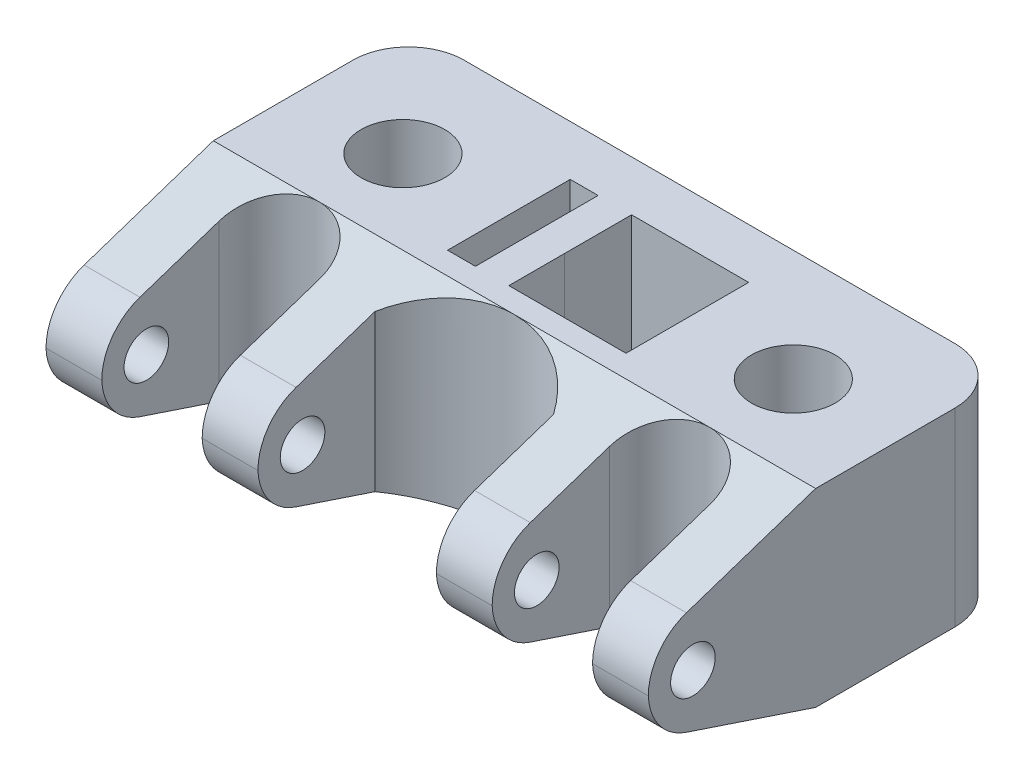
ISO-10303-21;
HEADER;
FILE_DESCRIPTION(('STEP AP214'),'2;1');
FILE_NAME('part.step','',(''),(''),'','','');
FILE_SCHEMA(('AUTOMOTIVE_DESIGN { 1 0 10303 214 1 1 1 1 }'));
ENDSEC;
DATA;
#1=APPLICATION_CONTEXT('core data for automotive mechanical design processes');
#2=APPLICATION_PROTOCOL_DEFINITION('international standard','automotive_design',2000,#1);
#3=PRODUCT_CONTEXT('',#1,'mechanical');
#4=PRODUCT('Part','Part','',(#3));
#5=PRODUCT_RELATED_PRODUCT_CATEGORY('part','',(#4));
#6=PRODUCT_DEFINITION_FORMATION('','',#4);
#7=PRODUCT_DEFINITION_CONTEXT('part definition',#1,'design');
#8=PRODUCT_DEFINITION('design','',#6,#7);
#9=PRODUCT_DEFINITION_SHAPE('','',#8);
#10=(LENGTH_UNIT() NAMED_UNIT(*) SI_UNIT(.MILLI.,.METRE.));
#11=(NAMED_UNIT(*) PLANE_ANGLE_UNIT() SI_UNIT($,.RADIAN.));
#12=(NAMED_UNIT(*) SI_UNIT($,.STERADIAN.) SOLID_ANGLE_UNIT());
#13=UNCERTAINTY_MEASURE_WITH_UNIT(LENGTH_MEASURE(1.E-05),#10,'distance_accuracy_value','');
#14=(GEOMETRIC_REPRESENTATION_CONTEXT(3) GLOBAL_UNCERTAINTY_ASSIGNED_CONTEXT((#13)) GLOBAL_UNIT_ASSIGNED_CONTEXT((#10,
#11,#12)) REPRESENTATION_CONTEXT('',''));
#15=CARTESIAN_POINT('',(0.,0.,0.));
#16=DIRECTION('',(0.,0.,1.));
#17=DIRECTION('',(1.,0.,0.));
#18=AXIS2_PLACEMENT_3D('',#15,#16,#17);
#19=CARTESIAN_POINT('',(-10.9955993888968,0.,11.));
#20=DIRECTION('',(0.,0.,1.));
#21=DIRECTION('',(1.,0.,0.));
#22=AXIS2_PLACEMENT_3D('',#19,#20,#21);
#23=PLANE('',#22);
#24=DIRECTION('',(1.,0.,0.));
#25=VECTOR('',#24,1.);
#26=CARTESIAN_POINT('',(-10.9955993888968,0.,11.));
#27=LINE('',#26,#25);
#28=CARTESIAN_POINT('',(0.,0.,11.));
#29=VERTEX_POINT('',#28);
#30=CARTESIAN_POINT('',(21.0044006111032,0.,11.));
#31=VERTEX_POINT('',#30);
#32=EDGE_CURVE('E85',#29,#31,#27,.T.);
#33=ORIENTED_EDGE('',*,*,#32,.F.);
#34=DIRECTION('',(0.,1.,0.));
#35=VECTOR('',#34,1.);
#36=CARTESIAN_POINT('',(0.,0.,11.));
#37=LINE('',#36,#35);
#38=CARTESIAN_POINT('',(0.,34.,11.));
#39=VERTEX_POINT('',#38);
#40=EDGE_CURVE('E316',#29,#39,#37,.T.);
#41=ORIENTED_EDGE('',*,*,#40,.T.);
#42=DIRECTION('',(1.,0.,0.));
#43=VECTOR('',#42,1.);
#44=CARTESIAN_POINT('',(-10.9955993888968,34.,11.));
#45=LINE('',#44,#43);
#46=CARTESIAN_POINT('',(21.0044006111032,34.,11.));
#47=VERTEX_POINT('',#46);
#48=EDGE_CURVE('E507',#39,#47,#45,.T.);
#49=ORIENTED_EDGE('',*,*,#48,.T.);
#50=DIRECTION('',(0.,1.,0.));
#51=VECTOR('',#50,1.);
#52=CARTESIAN_POINT('',(21.0044006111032,0.,11.));
#53=LINE('',#52,#51);
#54=EDGE_CURVE('E509',#31,#47,#53,.T.);
#55=ORIENTED_EDGE('',*,*,#54,.F.);
#56=EDGE_LOOP('',(#33,#41,#49,#55));
#57=FACE_BOUND('',#56,.T.);
#58=ADVANCED_FACE('F70',(#57),#23,.F.);
#59=CARTESIAN_POINT('',(21.0044006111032,0.,-11.));
#60=DIRECTION('',(0.,0.,-1.));
#61=DIRECTION('',(-1.,0.,0.));
#62=AXIS2_PLACEMENT_3D('',#59,#60,#61);
#63=PLANE('',#62);
#64=DIRECTION('',(-1.,0.,0.));
#65=VECTOR('',#64,1.);
#66=CARTESIAN_POINT('',(21.0044006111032,34.,-11.));
#67=LINE('',#66,#65);
#68=CARTESIAN_POINT('',(21.0044006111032,34.,-11.));
#69=VERTEX_POINT('',#68);
#70=CARTESIAN_POINT('',(0.0044006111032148,34.,-11.));
#71=VERTEX_POINT('',#70);
#72=EDGE_CURVE('E502',#69,#71,#67,.T.);
#73=ORIENTED_EDGE('',*,*,#72,.T.);
#74=DIRECTION('',(0.,1.,0.));
#75=VECTOR('',#74,1.);
#76=CARTESIAN_POINT('',(0.00440061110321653,0.,-11.));
#77=LINE('',#76,#75);
#78=CARTESIAN_POINT('',(0.0044006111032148,0.,-11.));
#79=VERTEX_POINT('',#78);
#80=EDGE_CURVE('E315',#79,#71,#77,.T.);
#81=ORIENTED_EDGE('',*,*,#80,.F.);
#82=DIRECTION('',(-1.,0.,0.));
#83=VECTOR('',#82,1.);
#84=CARTESIAN_POINT('',(21.0044006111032,0.,-11.));
#85=LINE('',#84,#83);
#86=CARTESIAN_POINT('',(21.0044006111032,0.,-11.));
#87=VERTEX_POINT('',#86);
#88=EDGE_CURVE('E325',#87,#79,#85,.T.);
#89=ORIENTED_EDGE('',*,*,#88,.F.);
#90=DIRECTION('',(0.,1.,0.));
#91=VECTOR('',#90,1.);
#92=CARTESIAN_POINT('',(21.0044006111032,0.,-11.));
#93=LINE('',#92,#91);
#94=EDGE_CURVE('E498',#87,#69,#93,.T.);
#95=ORIENTED_EDGE('',*,*,#94,.T.);
#96=EDGE_LOOP('',(#73,#81,#89,#95));
#97=FACE_BOUND('',#96,.T.);
#98=ADVANCED_FACE('F669',(#97),#63,.F.);
#99=CARTESIAN_POINT('',(49.0044006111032,34.,15.));
#100=DIRECTION('',(1.,0.,0.));
#101=DIRECTION('',(0.,1.,0.));
#102=AXIS2_PLACEMENT_3D('',#99,#100,#101);
#103=PLANE('',#102);
#104=CARTESIAN_POINT('',(49.0044006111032,16.7924077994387,37.));
#105=DIRECTION('',(1.,0.,0.));
#106=DIRECTION('',(0.,1.,0.));
#107=AXIS2_PLACEMENT_3D('',#104,#105,#106);
#108=CIRCLE('',#107,4.);
#109=CARTESIAN_POINT('',(49.0044006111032,20.7924077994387,37.));
#110=VERTEX_POINT('',#109);
#111=EDGE_CURVE('E378',#110,#110,#108,.T.);
#112=ORIENTED_EDGE('',*,*,#111,.T.);
#113=EDGE_LOOP('',(#112));
#114=FACE_BOUND('',#113,.T.);
#115=DIRECTION('',(0.,0.316227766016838,0.948683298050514));
#116=VECTOR('',#115,1.);
#117=CARTESIAN_POINT('',(49.0044006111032,3.39999999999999,25.2));
#118=LINE('',#117,#116);
#119=CARTESIAN_POINT('',(49.0044006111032,3.,24.));
#120=VERTEX_POINT('',#119);
#121=CARTESIAN_POINT('',(49.0044006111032,7.72367394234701,38.171021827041));
#122=VERTEX_POINT('',#121);
#123=EDGE_CURVE('E394',#120,#122,#118,.T.);
#124=ORIENTED_EDGE('',*,*,#123,.T.);
#125=CARTESIAN_POINT('',(49.0044006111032,17.2105069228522,35.0087441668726));
#126=DIRECTION('',(1.,0.,0.));
#127=DIRECTION('',(0.,1.,0.));
#128=AXIS2_PLACEMENT_3D('',#125,#126,#127);
#129=CIRCLE('',#128,10.);
#130=CARTESIAN_POINT('',(49.0044006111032,16.7924077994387,45.));
#131=VERTEX_POINT('',#130);
#132=EDGE_CURVE('E586',#122,#131,#129,.F.);
#133=ORIENTED_EDGE('',*,*,#132,.T.);
#134=CARTESIAN_POINT('',(49.0044006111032,16.7924077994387,35.));
#135=DIRECTION('',(1.,0.,0.));
#136=DIRECTION('',(0.,1.,0.));
#137=AXIS2_PLACEMENT_3D('',#134,#135,#136);
#138=CIRCLE('',#137,10.);
#139=CARTESIAN_POINT('',(49.0044006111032,26.2792407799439,38.1622776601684));
#140=VERTEX_POINT('',#139);
#141=EDGE_CURVE('E577',#131,#140,#138,.F.);
#142=ORIENTED_EDGE('',*,*,#141,.T.);
#143=DIRECTION('',(0.,0.316227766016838,-0.948683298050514));
#144=VECTOR('',#143,1.);
#145=CARTESIAN_POINT('',(49.0044006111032,34.,15.));
#146=LINE('',#145,#144);
#147=CARTESIAN_POINT('',(49.0044006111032,31.,24.));
#148=VERTEX_POINT('',#147);
#149=EDGE_CURVE('E428',#140,#148,#146,.T.);
#150=ORIENTED_EDGE('',*,*,#149,.T.);
#151=DIRECTION('',(0.,1.,0.));
#152=VECTOR('',#151,1.);
#153=CARTESIAN_POINT('',(49.0044006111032,0.,24.));
#154=LINE('',#153,#152);
#155=EDGE_CURVE('E449',#120,#148,#154,.T.);
#156=ORIENTED_EDGE('',*,*,#155,.F.);
#157=EDGE_LOOP('',(#124,#133,#142,#150,#156));
#158=FACE_BOUND('',#157,.T.);
#159=ADVANCED_FACE('F640',(#114,#158),#103,.F.);
#160=CARTESIAN_POINT('',(-20.9955993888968,34.,15.));
#161=DIRECTION('',(1.,0.,0.));
#162=DIRECTION('',(0.,1.,0.));
#163=AXIS2_PLACEMENT_3D('',#160,#161,#162);
#164=PLANE('',#163);
#165=CARTESIAN_POINT('',(-20.9955993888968,16.7924077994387,37.));
#166=DIRECTION('',(1.,0.,0.));
#167=DIRECTION('',(0.,1.,0.));
#168=AXIS2_PLACEMENT_3D('',#165,#166,#167);
#169=CIRCLE('',#168,4.);
#170=CARTESIAN_POINT('',(-20.9955993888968,20.7924077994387,37.));
#171=VERTEX_POINT('',#170);
#172=EDGE_CURVE('E375',#171,#171,#169,.T.);
#173=ORIENTED_EDGE('',*,*,#172,.T.);
#174=EDGE_LOOP('',(#173));
#175=FACE_BOUND('',#174,.T.);
#176=DIRECTION('',(0.,0.316227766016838,0.948683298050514));
#177=VECTOR('',#176,1.);
#178=CARTESIAN_POINT('',(-20.9955993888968,3.39999999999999,25.2));
#179=LINE('',#178,#177);
#180=CARTESIAN_POINT('',(-20.9955993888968,3.,24.));
#181=VERTEX_POINT('',#180);
#182=CARTESIAN_POINT('',(-20.9955993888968,7.72367394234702,38.1710218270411));
#183=VERTEX_POINT('',#182);
#184=EDGE_CURVE('E411',#181,#183,#179,.T.);
#185=ORIENTED_EDGE('',*,*,#184,.T.);
#186=CARTESIAN_POINT('',(-20.9955993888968,17.2105069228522,35.0087441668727));
#187=DIRECTION('',(1.,0.,0.));
#188=DIRECTION('',(0.,1.,0.));
#189=AXIS2_PLACEMENT_3D('',#186,#187,#188);
#190=CIRCLE('',#189,10.);
#191=CARTESIAN_POINT('',(-20.9955993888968,16.7924077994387,45.));
#192=VERTEX_POINT('',#191);
#193=EDGE_CURVE('E554',#183,#192,#190,.F.);
#194=ORIENTED_EDGE('',*,*,#193,.T.);
#195=CARTESIAN_POINT('',(-20.9955993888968,16.7924077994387,35.));
#196=DIRECTION('',(1.,0.,0.));
#197=DIRECTION('',(0.,1.,0.));
#198=AXIS2_PLACEMENT_3D('',#195,#196,#197);
#199=CIRCLE('',#198,10.);
#200=CARTESIAN_POINT('',(-20.9955993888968,26.2792407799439,38.1622776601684));
#201=VERTEX_POINT('',#200);
#202=EDGE_CURVE('E545',#192,#201,#199,.F.);
#203=ORIENTED_EDGE('',*,*,#202,.T.);
#204=DIRECTION('',(0.,0.316227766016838,-0.948683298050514));
#205=VECTOR('',#204,1.);
#206=CARTESIAN_POINT('',(-20.9955993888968,34.,15.));
#207=LINE('',#206,#205);
#208=CARTESIAN_POINT('',(-20.9955993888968,31.,24.));
#209=VERTEX_POINT('',#208);
#210=EDGE_CURVE('E445',#201,#209,#207,.T.);
#211=ORIENTED_EDGE('',*,*,#210,.T.);
#212=DIRECTION('',(0.,1.,0.));
#213=VECTOR('',#212,1.);
#214=CARTESIAN_POINT('',(-20.9955993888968,0.,24.));
#215=LINE('',#214,#213);
#216=EDGE_CURVE('E459',#181,#209,#215,.T.);
#217=ORIENTED_EDGE('',*,*,#216,.F.);
#218=EDGE_LOOP('',(#185,#194,#203,#211,#217));
#219=FACE_BOUND('',#218,.T.);
#220=ADVANCED_FACE('F709',(#175,#219),#164,.F.);
#221=CARTESIAN_POINT('',(0.,34.,0.));
#222=DIRECTION('',(0.,-1.,0.));
#223=DIRECTION('',(0.,0.,-1.));
#224=AXIS2_PLACEMENT_3D('',#221,#222,#223);
#225=PLANE('',#224);
#226=ORIENTED_EDGE('',*,*,#48,.F.);
#227=DIRECTION('',(0.,0.,-1.));
#228=VECTOR('',#227,1.);
#229=CARTESIAN_POINT('',(0.,34.,1.00000000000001));
#230=LINE('',#229,#228);
#231=CARTESIAN_POINT('',(0.,34.,1.00000000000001));
#232=VERTEX_POINT('',#231);
#233=EDGE_CURVE('E336',#39,#232,#230,.T.);
#234=ORIENTED_EDGE('',*,*,#233,.T.);
#235=DIRECTION('',(0.000366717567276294,0.,-0.999999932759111));
#236=VECTOR('',#235,1.);
#237=CARTESIAN_POINT('',(0.,34.,1.00000000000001));
#238=LINE('',#237,#236);
#239=EDGE_CURVE('E310',#232,#71,#238,.T.);
#240=ORIENTED_EDGE('',*,*,#239,.T.);
#241=ORIENTED_EDGE('',*,*,#72,.F.);
#242=DIRECTION('',(0.,0.,-1.));
#243=VECTOR('',#242,1.);
#244=CARTESIAN_POINT('',(21.0044006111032,34.,0.));
#245=LINE('',#244,#243);
#246=EDGE_CURVE('E485',#47,#69,#245,.T.);
#247=ORIENTED_EDGE('',*,*,#246,.F.);
#248=EDGE_LOOP('',(#226,#234,#240,#241,#247));
#249=FACE_BOUND('',#248,.T.);
#250=DIRECTION('',(0.,0.,1.));
#251=VECTOR('',#250,1.);
#252=CARTESIAN_POINT('',(59.0044006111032,34.,-20.));
#253=LINE('',#252,#251);
#254=CARTESIAN_POINT('',(59.0044006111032,34.,-10.));
#255=VERTEX_POINT('',#254);
#256=CARTESIAN_POINT('',(59.0044006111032,34.,15.));
#257=VERTEX_POINT('',#256);
#258=EDGE_CURVE('E463',#255,#257,#253,.T.);
#259=ORIENTED_EDGE('',*,*,#258,.F.);
#260=CARTESIAN_POINT('',(49.0044006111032,34.,-10.));
#261=DIRECTION('',(0.,-1.,0.));
#262=DIRECTION('',(0.,0.,-1.));
#263=AXIS2_PLACEMENT_3D('',#260,#261,#262);
#264=CIRCLE('',#263,10.);
#265=CARTESIAN_POINT('',(49.0044006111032,34.,-20.));
#266=VERTEX_POINT('',#265);
#267=EDGE_CURVE('E603',#255,#266,#264,.F.);
#268=ORIENTED_EDGE('',*,*,#267,.T.);
#269=DIRECTION('',(1.,0.,0.));
#270=VECTOR('',#269,1.);
#271=CARTESIAN_POINT('',(55.0044006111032,34.,-20.));
#272=LINE('',#271,#270);
#273=CARTESIAN_POINT('',(-38.9955993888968,34.,-20.));
#274=VERTEX_POINT('',#273);
#275=EDGE_CURVE('E472',#274,#266,#272,.T.);
#276=ORIENTED_EDGE('',*,*,#275,.F.);
#277=CARTESIAN_POINT('',(-38.9955993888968,34.,-10.));
#278=DIRECTION('',(0.,-1.,0.));
#279=DIRECTION('',(0.,0.,-1.));
#280=AXIS2_PLACEMENT_3D('',#277,#278,#279);
#281=CIRCLE('',#280,10.);
#282=CARTESIAN_POINT('',(-48.9955993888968,34.,-10.));
#283=VERTEX_POINT('',#282);
#284=EDGE_CURVE('E598',#274,#283,#281,.F.);
#285=ORIENTED_EDGE('',*,*,#284,.T.);
#286=DIRECTION('',(0.,0.,1.));
#287=VECTOR('',#286,1.);
#288=CARTESIAN_POINT('',(-48.9955993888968,34.,-20.));
#289=LINE('',#288,#287);
#290=CARTESIAN_POINT('',(-48.9955993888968,34.,15.));
#291=VERTEX_POINT('',#290);
#292=EDGE_CURVE('E465',#283,#291,#289,.T.);
#293=ORIENTED_EDGE('',*,*,#292,.T.);
#294=DIRECTION('',(-1.,0.,0.));
#295=VECTOR('',#294,1.);
#296=CARTESIAN_POINT('',(59.0044006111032,34.,15.));
#297=LINE('',#296,#295);
#298=CARTESIAN_POINT('',(-29.9955993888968,34.,15.));
#299=VERTEX_POINT('',#298);
#300=EDGE_CURVE('E418',#299,#291,#297,.T.);
#301=ORIENTED_EDGE('',*,*,#300,.F.);
#302=CARTESIAN_POINT('',(5.00440061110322,34.,15.));
#303=VERTEX_POINT('',#302);
#304=EDGE_CURVE('E806',#303,#299,#297,.T.);
#305=ORIENTED_EDGE('',*,*,#304,.F.);
#306=CARTESIAN_POINT('',(40.0044006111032,34.,15.));
#307=VERTEX_POINT('',#306);
#308=EDGE_CURVE('E425',#307,#303,#297,.T.);
#309=ORIENTED_EDGE('',*,*,#308,.F.);
#310=EDGE_CURVE('E421',#257,#307,#297,.T.);
#311=ORIENTED_EDGE('',*,*,#310,.F.);
#312=EDGE_LOOP('',(#259,#268,#276,#285,#293,#301,#305,#309,#311));
#313=FACE_BOUND('',#312,.T.);
#314=DIRECTION('',(0.,0.,1.));
#315=VECTOR('',#314,1.);
#316=CARTESIAN_POINT('',(-5.99559938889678,34.,11.));
#317=LINE('',#316,#315);
#318=CARTESIAN_POINT('',(-5.99559938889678,34.,-11.));
#319=VERTEX_POINT('',#318);
#320=CARTESIAN_POINT('',(-5.99559938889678,34.,11.));
#321=VERTEX_POINT('',#320);
#322=EDGE_CURVE('E333',#319,#321,#317,.T.);
#323=ORIENTED_EDGE('',*,*,#322,.T.);
#324=CARTESIAN_POINT('',(-10.9955993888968,34.,11.));
#325=VERTEX_POINT('',#324);
#326=EDGE_CURVE('E491',#325,#321,#45,.T.);
#327=ORIENTED_EDGE('',*,*,#326,.F.);
#328=DIRECTION('',(0.,0.,1.));
#329=VECTOR('',#328,1.);
#330=CARTESIAN_POINT('',(-10.9955993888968,34.,-11.));
#331=LINE('',#330,#329);
#332=CARTESIAN_POINT('',(-10.9955993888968,34.,-11.));
#333=VERTEX_POINT('',#332);
#334=EDGE_CURVE('E504',#333,#325,#331,.T.);
#335=ORIENTED_EDGE('',*,*,#334,.F.);
#336=EDGE_CURVE('E501',#319,#333,#67,.T.);
#337=ORIENTED_EDGE('',*,*,#336,.F.);
#338=EDGE_LOOP('',(#323,#327,#335,#337));
#339=FACE_BOUND('',#338,.T.);
#340=CARTESIAN_POINT('',(-29.9955993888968,34.,0.));
#341=DIRECTION('',(0.,1.,0.));
#342=DIRECTION('',(0.,0.,1.));
#343=AXIS2_PLACEMENT_3D('',#340,#341,#342);
#344=CIRCLE('',#343,7.5);
#345=CARTESIAN_POINT('',(-29.9955993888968,34.,7.5));
#346=VERTEX_POINT('',#345);
#347=EDGE_CURVE('E479',#346,#346,#344,.T.);
#348=ORIENTED_EDGE('',*,*,#347,.F.);
#349=EDGE_LOOP('',(#348));
#350=FACE_BOUND('',#349,.T.);
#351=CARTESIAN_POINT('',(40.0044006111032,34.,0.));
#352=DIRECTION('',(0.,1.,0.));
#353=DIRECTION('',(0.,0.,1.));
#354=AXIS2_PLACEMENT_3D('',#351,#352,#353);
#355=CIRCLE('',#354,7.5);
#356=CARTESIAN_POINT('',(40.0044006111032,34.,7.5));
#357=VERTEX_POINT('',#356);
#358=EDGE_CURVE('E475',#357,#357,#355,.T.);
#359=ORIENTED_EDGE('',*,*,#358,.F.);
#360=EDGE_LOOP('',(#359));
#361=FACE_BOUND('',#360,.T.);
#362=ADVANCED_FACE('F623',(#249,#313,#339,#350,#361),#225,.F.);
#363=CARTESIAN_POINT('',(0.,0.,0.));
#364=DIRECTION('',(0.,-1.,0.));
#365=DIRECTION('',(0.,0.,-1.));
#366=AXIS2_PLACEMENT_3D('',#363,#364,#365);
#367=PLANE('',#366);
#368=DIRECTION('',(0.,0.,-1.));
#369=VECTOR('',#368,1.);
#370=CARTESIAN_POINT('',(0.,0.,1.00000000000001));
#371=LINE('',#370,#369);
#372=CARTESIAN_POINT('',(0.,0.,1.00000000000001));
#373=VERTEX_POINT('',#372);
#374=EDGE_CURVE('E323',#29,#373,#371,.T.);
#375=ORIENTED_EDGE('',*,*,#374,.F.);
#376=ORIENTED_EDGE('',*,*,#32,.T.);
#377=DIRECTION('',(0.,0.,-1.));
#378=VECTOR('',#377,1.);
#379=CARTESIAN_POINT('',(21.0044006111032,0.,11.));
#380=LINE('',#379,#378);
#381=EDGE_CURVE('E488',#31,#87,#380,.T.);
#382=ORIENTED_EDGE('',*,*,#381,.T.);
#383=ORIENTED_EDGE('',*,*,#88,.T.);
#384=DIRECTION('',(0.000366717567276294,0.,-0.999999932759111));
#385=VECTOR('',#384,1.);
#386=CARTESIAN_POINT('',(0.,0.,1.00000000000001));
#387=LINE('',#386,#385);
#388=EDGE_CURVE('E308',#373,#79,#387,.T.);
#389=ORIENTED_EDGE('',*,*,#388,.F.);
#390=EDGE_LOOP('',(#375,#376,#382,#383,#389));
#391=FACE_BOUND('',#390,.T.);
#392=CARTESIAN_POINT('',(40.0044006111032,0.,0.));
#393=DIRECTION('',(0.,1.,0.));
#394=DIRECTION('',(0.,0.,1.));
#395=AXIS2_PLACEMENT_3D('',#392,#393,#394);
#396=CIRCLE('',#395,4.25000000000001);
#397=CARTESIAN_POINT('',(40.0044006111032,0.,4.25000000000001));
#398=VERTEX_POINT('',#397);
#399=EDGE_CURVE('E346',#398,#398,#396,.T.);
#400=ORIENTED_EDGE('',*,*,#399,.T.);
#401=EDGE_LOOP('',(#400));
#402=FACE_BOUND('',#401,.T.);
#403=CARTESIAN_POINT('',(-29.9955993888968,0.,0.));
#404=DIRECTION('',(0.,1.,0.));
#405=DIRECTION('',(0.,0.,1.));
#406=AXIS2_PLACEMENT_3D('',#403,#404,#405);
#407=CIRCLE('',#406,4.25);
#408=CARTESIAN_POINT('',(-29.9955993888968,0.,4.25));
#409=VERTEX_POINT('',#408);
#410=EDGE_CURVE('E352',#409,#409,#407,.T.);
#411=ORIENTED_EDGE('',*,*,#410,.T.);
#412=EDGE_LOOP('',(#411));
#413=FACE_BOUND('',#412,.T.);
#414=DIRECTION('',(-1.,0.,0.));
#415=VECTOR('',#414,1.);
#416=CARTESIAN_POINT('',(55.0044006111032,0.,-20.));
#417=LINE('',#416,#415);
#418=CARTESIAN_POINT('',(49.0044006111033,0.,-20.));
#419=VERTEX_POINT('',#418);
#420=CARTESIAN_POINT('',(-38.9955993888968,0.,-20.));
#421=VERTEX_POINT('',#420);
#422=EDGE_CURVE('E469',#419,#421,#417,.T.);
#423=ORIENTED_EDGE('',*,*,#422,.F.);
#424=CARTESIAN_POINT('',(49.0044006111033,0.,-10.));
#425=DIRECTION('',(0.,-1.,0.));
#426=DIRECTION('',(0.,0.,-1.));
#427=AXIS2_PLACEMENT_3D('',#424,#425,#426);
#428=CIRCLE('',#427,10.);
#429=CARTESIAN_POINT('',(59.0044006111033,0.,-10.));
#430=VERTEX_POINT('',#429);
#431=EDGE_CURVE('E12',#419,#430,#428,.T.);
#432=ORIENTED_EDGE('',*,*,#431,.T.);
#433=DIRECTION('',(0.,0.,1.));
#434=VECTOR('',#433,1.);
#435=CARTESIAN_POINT('',(59.0044006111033,0.,-20.));
#436=LINE('',#435,#434);
#437=CARTESIAN_POINT('',(59.0044006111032,0.,15.));
#438=VERTEX_POINT('',#437);
#439=EDGE_CURVE('E462',#430,#438,#436,.T.);
#440=ORIENTED_EDGE('',*,*,#439,.T.);
#441=DIRECTION('',(-1.,0.,0.));
#442=VECTOR('',#441,1.);
#443=CARTESIAN_POINT('',(59.0044006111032,0.,15.));
#444=LINE('',#443,#442);
#445=CARTESIAN_POINT('',(40.0044006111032,0.,15.));
#446=VERTEX_POINT('',#445);
#447=EDGE_CURVE('E388',#438,#446,#444,.T.);
#448=ORIENTED_EDGE('',*,*,#447,.T.);
#449=CARTESIAN_POINT('',(5.00440061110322,0.,15.));
#450=VERTEX_POINT('',#449);
#451=EDGE_CURVE('E392',#446,#450,#444,.T.);
#452=ORIENTED_EDGE('',*,*,#451,.T.);
#453=CARTESIAN_POINT('',(-29.9955993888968,0.,15.));
#454=VERTEX_POINT('',#453);
#455=EDGE_CURVE('E771',#450,#454,#444,.T.);
#456=ORIENTED_EDGE('',*,*,#455,.T.);
#457=CARTESIAN_POINT('',(-48.9955993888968,0.,15.));
#458=VERTEX_POINT('',#457);
#459=EDGE_CURVE('E385',#454,#458,#444,.T.);
#460=ORIENTED_EDGE('',*,*,#459,.T.);
#461=DIRECTION('',(0.,0.,1.));
#462=VECTOR('',#461,1.);
#463=CARTESIAN_POINT('',(-48.9955993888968,0.,-20.));
#464=LINE('',#463,#462);
#465=CARTESIAN_POINT('',(-48.9955993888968,0.,-10.));
#466=VERTEX_POINT('',#465);
#467=EDGE_CURVE('E467',#466,#458,#464,.T.);
#468=ORIENTED_EDGE('',*,*,#467,.F.);
#469=CARTESIAN_POINT('',(-38.9955993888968,0.,-10.));
#470=DIRECTION('',(0.,-1.,0.));
#471=DIRECTION('',(0.,0.,-1.));
#472=AXIS2_PLACEMENT_3D('',#469,#470,#471);
#473=CIRCLE('',#472,10.);
#474=EDGE_CURVE('E593',#466,#421,#473,.T.);
#475=ORIENTED_EDGE('',*,*,#474,.T.);
#476=EDGE_LOOP('',(#423,#432,#440,#448,#452,#456,#460,#468,#475));
#477=FACE_BOUND('',#476,.T.);
#478=CARTESIAN_POINT('',(-10.9955993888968,0.,11.));
#479=VERTEX_POINT('',#478);
#480=CARTESIAN_POINT('',(-5.99559938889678,0.,11.));
#481=VERTEX_POINT('',#480);
#482=EDGE_CURVE('E496',#479,#481,#27,.T.);
#483=ORIENTED_EDGE('',*,*,#482,.T.);
#484=DIRECTION('',(0.,0.,1.));
#485=VECTOR('',#484,1.);
#486=CARTESIAN_POINT('',(-5.99559938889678,0.,-11.));
#487=LINE('',#486,#485);
#488=CARTESIAN_POINT('',(-5.99559938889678,0.,-11.));
#489=VERTEX_POINT('',#488);
#490=EDGE_CURVE('E328',#489,#481,#487,.T.);
#491=ORIENTED_EDGE('',*,*,#490,.F.);
#492=CARTESIAN_POINT('',(-10.9955993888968,0.,-11.));
#493=VERTEX_POINT('',#492);
#494=EDGE_CURVE('E490',#489,#493,#85,.T.);
#495=ORIENTED_EDGE('',*,*,#494,.T.);
#496=DIRECTION('',(0.,0.,1.));
#497=VECTOR('',#496,1.);
#498=CARTESIAN_POINT('',(-10.9955993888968,0.,-11.));
#499=LINE('',#498,#497);
#500=EDGE_CURVE('E493',#493,#479,#499,.T.);
#501=ORIENTED_EDGE('',*,*,#500,.T.);
#502=EDGE_LOOP('',(#483,#491,#495,#501));
#503=FACE_BOUND('',#502,.T.);
#504=ADVANCED_FACE('F321',(#391,#402,#413,#477,#503),#367,.T.);
#505=ORIENTED_EDGE('',*,*,#326,.T.);
#506=DIRECTION('',(0.,1.,0.));
#507=VECTOR('',#506,1.);
#508=CARTESIAN_POINT('',(-5.99559938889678,0.,11.));
#509=LINE('',#508,#507);
#510=EDGE_CURVE('E93',#481,#321,#509,.T.);
#511=ORIENTED_EDGE('',*,*,#510,.F.);
#512=ORIENTED_EDGE('',*,*,#482,.F.);
#513=DIRECTION('',(0.,1.,0.));
#514=VECTOR('',#513,1.);
#515=CARTESIAN_POINT('',(-10.9955993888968,0.,11.));
#516=LINE('',#515,#514);
#517=EDGE_CURVE('E513',#479,#325,#516,.T.);
#518=ORIENTED_EDGE('',*,*,#517,.T.);
#519=EDGE_LOOP('',(#505,#511,#512,#518));
#520=FACE_BOUND('',#519,.T.);
#521=ADVANCED_FACE('F671',(#520),#23,.F.);
#522=CARTESIAN_POINT('',(-10.9955993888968,0.,-11.));
#523=DIRECTION('',(-1.,0.,0.));
#524=DIRECTION('',(0.,0.,1.));
#525=AXIS2_PLACEMENT_3D('',#522,#523,#524);
#526=PLANE('',#525);
#527=ORIENTED_EDGE('',*,*,#334,.T.);
#528=ORIENTED_EDGE('',*,*,#517,.F.);
#529=ORIENTED_EDGE('',*,*,#500,.F.);
#530=DIRECTION('',(0.,1.,0.));
#531=VECTOR('',#530,1.);
#532=CARTESIAN_POINT('',(-10.9955993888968,0.,-11.));
#533=LINE('',#532,#531);
#534=EDGE_CURVE('E515',#493,#333,#533,.T.);
#535=ORIENTED_EDGE('',*,*,#534,.T.);
#536=EDGE_LOOP('',(#527,#528,#529,#535));
#537=FACE_BOUND('',#536,.T.);
#538=ADVANCED_FACE('F681',(#537),#526,.F.);
#539=ORIENTED_EDGE('',*,*,#494,.F.);
#540=DIRECTION('',(0.,1.,0.));
#541=VECTOR('',#540,1.);
#542=CARTESIAN_POINT('',(-5.99559938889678,0.,-11.));
#543=LINE('',#542,#541);
#544=EDGE_CURVE('E339',#489,#319,#543,.T.);
#545=ORIENTED_EDGE('',*,*,#544,.T.);
#546=ORIENTED_EDGE('',*,*,#336,.T.);
#547=ORIENTED_EDGE('',*,*,#534,.F.);
#548=EDGE_LOOP('',(#539,#545,#546,#547));
#549=FACE_BOUND('',#548,.T.);
#550=ADVANCED_FACE('F677',(#549),#63,.F.);
#551=CARTESIAN_POINT('',(21.0044006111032,0.,0.));
#552=DIRECTION('',(1.,0.,0.));
#553=DIRECTION('',(0.,0.,-1.));
#554=AXIS2_PLACEMENT_3D('',#551,#552,#553);
#555=PLANE('',#554);
#556=ORIENTED_EDGE('',*,*,#246,.T.);
#557=ORIENTED_EDGE('',*,*,#94,.F.);
#558=ORIENTED_EDGE('',*,*,#381,.F.);
#559=ORIENTED_EDGE('',*,*,#54,.T.);
#560=EDGE_LOOP('',(#556,#557,#558,#559));
#561=FACE_BOUND('',#560,.T.);
#562=ADVANCED_FACE('F700',(#561),#555,.F.);
#563=CARTESIAN_POINT('',(-29.9955993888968,10.,0.));
#564=DIRECTION('',(0.,1.,0.));
#565=DIRECTION('',(0.,0.,1.));
#566=AXIS2_PLACEMENT_3D('',#563,#564,#565);
#567=CYLINDRICAL_SURFACE('',#566,7.5);
#568=CARTESIAN_POINT('',(-29.9955993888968,10.,0.));
#569=DIRECTION('',(0.,1.,0.));
#570=DIRECTION('',(0.,0.,1.));
#571=AXIS2_PLACEMENT_3D('',#568,#569,#570);
#572=CIRCLE('',#571,7.5);
#573=CARTESIAN_POINT('',(-29.9955993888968,10.,7.5));
#574=VERTEX_POINT('',#573);
#575=EDGE_CURVE('E482',#574,#574,#572,.T.);
#576=ORIENTED_EDGE('',*,*,#575,.F.);
#577=EDGE_LOOP('',(#576));
#578=FACE_BOUND('',#577,.T.);
#579=ORIENTED_EDGE('',*,*,#347,.T.);
#580=EDGE_LOOP('',(#579));
#581=FACE_BOUND('',#580,.T.);
#582=ADVANCED_FACE('F704',(#578,#581),#567,.F.);
#583=CARTESIAN_POINT('',(-29.9955993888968,10.,0.));
#584=DIRECTION('',(0.,1.,0.));
#585=DIRECTION('',(0.,0.,1.));
#586=AXIS2_PLACEMENT_3D('',#583,#584,#585);
#587=PLANE('',#586);
#588=CARTESIAN_POINT('',(-29.9955993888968,10.,0.));
#589=DIRECTION('',(0.,1.,0.));
#590=DIRECTION('',(0.,0.,1.));
#591=AXIS2_PLACEMENT_3D('',#588,#589,#590);
#592=CIRCLE('',#591,4.25);
#593=CARTESIAN_POINT('',(-29.9955993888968,10.,4.25));
#594=VERTEX_POINT('',#593);
#595=EDGE_CURVE('E349',#594,#594,#592,.T.);
#596=ORIENTED_EDGE('',*,*,#595,.F.);
#597=EDGE_LOOP('',(#596));
#598=FACE_BOUND('',#597,.T.);
#599=ORIENTED_EDGE('',*,*,#575,.T.);
#600=EDGE_LOOP('',(#599));
#601=FACE_BOUND('',#600,.T.);
#602=ADVANCED_FACE('F843',(#598,#601),#587,.T.);
#603=CARTESIAN_POINT('',(40.0044006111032,10.,0.));
#604=DIRECTION('',(0.,1.,0.));
#605=DIRECTION('',(0.,0.,1.));
#606=AXIS2_PLACEMENT_3D('',#603,#604,#605);
#607=CYLINDRICAL_SURFACE('',#606,7.5);
#608=CARTESIAN_POINT('',(40.0044006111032,10.,0.));
#609=DIRECTION('',(0.,1.,0.));
#610=DIRECTION('',(0.,0.,1.));
#611=AXIS2_PLACEMENT_3D('',#608,#609,#610);
#612=CIRCLE('',#611,7.5);
#613=CARTESIAN_POINT('',(40.0044006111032,10.,7.5));
#614=VERTEX_POINT('',#613);
#615=EDGE_CURVE('E476',#614,#614,#612,.T.);
#616=ORIENTED_EDGE('',*,*,#615,.F.);
#617=EDGE_LOOP('',(#616));
#618=FACE_BOUND('',#617,.T.);
#619=ORIENTED_EDGE('',*,*,#358,.T.);
#620=EDGE_LOOP('',(#619));
#621=FACE_BOUND('',#620,.T.);
#622=ADVANCED_FACE('F839',(#618,#621),#607,.F.);
#623=CARTESIAN_POINT('',(40.0044006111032,10.,0.));
#624=DIRECTION('',(0.,1.,0.));
#625=DIRECTION('',(0.,0.,1.));
#626=AXIS2_PLACEMENT_3D('',#623,#624,#625);
#627=PLANE('',#626);
#628=CARTESIAN_POINT('',(40.0044006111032,10.,0.));
#629=DIRECTION('',(0.,1.,0.));
#630=DIRECTION('',(0.,0.,1.));
#631=AXIS2_PLACEMENT_3D('',#628,#629,#630);
#632=CIRCLE('',#631,4.25000000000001);
#633=CARTESIAN_POINT('',(40.0044006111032,10.,4.25000000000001));
#634=VERTEX_POINT('',#633);
#635=EDGE_CURVE('E342',#634,#634,#632,.T.);
#636=ORIENTED_EDGE('',*,*,#635,.F.);
#637=EDGE_LOOP('',(#636));
#638=FACE_BOUND('',#637,.T.);
#639=ORIENTED_EDGE('',*,*,#615,.T.);
#640=EDGE_LOOP('',(#639));
#641=FACE_BOUND('',#640,.T.);
#642=ADVANCED_FACE('F836',(#638,#641),#627,.T.);
#643=CARTESIAN_POINT('',(0.,0.,-20.));
#644=DIRECTION('',(0.,0.,-1.));
#645=DIRECTION('',(-1.,0.,0.));
#646=AXIS2_PLACEMENT_3D('',#643,#644,#645);
#647=PLANE('',#646);
#648=ORIENTED_EDGE('',*,*,#275,.T.);
#649=DIRECTION('',(0.,1.,0.));
#650=VECTOR('',#649,1.);
#651=CARTESIAN_POINT('',(49.0044006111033,0.,-20.));
#652=LINE('',#651,#650);
#653=EDGE_CURVE('E78',#266,#419,#652,.F.);
#654=ORIENTED_EDGE('',*,*,#653,.T.);
#655=ORIENTED_EDGE('',*,*,#422,.T.);
#656=DIRECTION('',(0.,-1.,0.));
#657=VECTOR('',#656,1.);
#658=CARTESIAN_POINT('',(-38.9955993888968,0.,-20.));
#659=LINE('',#658,#657);
#660=EDGE_CURVE('E596',#421,#274,#659,.F.);
#661=ORIENTED_EDGE('',*,*,#660,.T.);
#662=EDGE_LOOP('',(#648,#654,#655,#661));
#663=FACE_BOUND('',#662,.T.);
#664=ADVANCED_FACE('F607',(#663),#647,.T.);
#665=CARTESIAN_POINT('',(-38.9955993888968,34.,15.));
#666=DIRECTION('',(-1.,0.,0.));
#667=DIRECTION('',(0.,-1.,0.));
#668=AXIS2_PLACEMENT_3D('',#665,#666,#667);
#669=PLANE('',#668);
#670=CARTESIAN_POINT('',(-38.9955993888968,16.7924077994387,37.));
#671=DIRECTION('',(-1.,0.,0.));
#672=DIRECTION('',(0.,-1.,0.));
#673=AXIS2_PLACEMENT_3D('',#670,#671,#672);
#674=CIRCLE('',#673,4.);
#675=CARTESIAN_POINT('',(-38.9955993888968,12.7924077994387,37.));
#676=VERTEX_POINT('',#675);
#677=EDGE_CURVE('E372',#676,#676,#674,.T.);
#678=ORIENTED_EDGE('',*,*,#677,.T.);
#679=EDGE_LOOP('',(#678));
#680=FACE_BOUND('',#679,.T.);
#681=CARTESIAN_POINT('',(-38.9955993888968,16.7924077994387,35.));
#682=DIRECTION('',(-1.,0.,0.));
#683=DIRECTION('',(0.,-1.,0.));
#684=AXIS2_PLACEMENT_3D('',#681,#682,#683);
#685=CIRCLE('',#684,10.);
#686=CARTESIAN_POINT('',(-38.9955993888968,26.2792407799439,38.1622776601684));
#687=VERTEX_POINT('',#686);
#688=CARTESIAN_POINT('',(-38.9955993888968,16.7924077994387,45.));
#689=VERTEX_POINT('',#688);
#690=EDGE_CURVE('E533',#687,#689,#685,.F.);
#691=ORIENTED_EDGE('',*,*,#690,.T.);
#692=CARTESIAN_POINT('',(-38.9955993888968,17.2105069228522,35.0087441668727));
#693=DIRECTION('',(-1.,0.,0.));
#694=DIRECTION('',(0.,-1.,0.));
#695=AXIS2_PLACEMENT_3D('',#692,#693,#694);
#696=CIRCLE('',#695,10.);
#697=CARTESIAN_POINT('',(-38.9955993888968,7.72367394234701,38.171021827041));
#698=VERTEX_POINT('',#697);
#699=EDGE_CURVE('E540',#689,#698,#696,.F.);
#700=ORIENTED_EDGE('',*,*,#699,.T.);
#701=DIRECTION('',(0.,-0.316227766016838,-0.948683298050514));
#702=VECTOR('',#701,1.);
#703=CARTESIAN_POINT('',(-38.9955993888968,3.39999999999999,25.2));
#704=LINE('',#703,#702);
#705=CARTESIAN_POINT('',(-38.9955993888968,3.,24.));
#706=VERTEX_POINT('',#705);
#707=EDGE_CURVE('E409',#698,#706,#704,.T.);
#708=ORIENTED_EDGE('',*,*,#707,.T.);
#709=DIRECTION('',(0.,1.,0.));
#710=VECTOR('',#709,1.);
#711=CARTESIAN_POINT('',(-38.9955993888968,0.,24.));
#712=LINE('',#711,#710);
#713=CARTESIAN_POINT('',(-38.9955993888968,31.,24.));
#714=VERTEX_POINT('',#713);
#715=EDGE_CURVE('E457',#706,#714,#712,.T.);
#716=ORIENTED_EDGE('',*,*,#715,.T.);
#717=DIRECTION('',(0.,-0.316227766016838,0.948683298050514));
#718=VECTOR('',#717,1.);
#719=CARTESIAN_POINT('',(-38.9955993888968,34.,15.));
#720=LINE('',#719,#718);
#721=EDGE_CURVE('E442',#714,#687,#720,.T.);
#722=ORIENTED_EDGE('',*,*,#721,.T.);
#723=EDGE_LOOP('',(#691,#700,#708,#716,#722));
#724=FACE_BOUND('',#723,.T.);
#725=ADVANCED_FACE('F786',(#680,#724),#669,.F.);
#726=CARTESIAN_POINT('',(31.0044006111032,34.,15.));
#727=DIRECTION('',(-1.,0.,0.));
#728=DIRECTION('',(0.,-1.,0.));
#729=AXIS2_PLACEMENT_3D('',#726,#727,#728);
#730=PLANE('',#729);
#731=CARTESIAN_POINT('',(31.0044006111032,16.7924077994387,37.));
#732=DIRECTION('',(-1.,0.,0.));
#733=DIRECTION('',(0.,-1.,0.));
#734=AXIS2_PLACEMENT_3D('',#731,#732,#733);
#735=CIRCLE('',#734,4.);
#736=CARTESIAN_POINT('',(31.0044006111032,12.7924077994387,37.));
#737=VERTEX_POINT('',#736);
#738=EDGE_CURVE('E369',#737,#737,#735,.T.);
#739=ORIENTED_EDGE('',*,*,#738,.T.);
#740=EDGE_LOOP('',(#739));
#741=FACE_BOUND('',#740,.T.);
#742=CARTESIAN_POINT('',(31.0044006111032,16.7924077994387,35.));
#743=DIRECTION('',(-1.,0.,0.));
#744=DIRECTION('',(0.,-1.,0.));
#745=AXIS2_PLACEMENT_3D('',#742,#743,#744);
#746=CIRCLE('',#745,10.);
#747=CARTESIAN_POINT('',(31.0044006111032,26.2792407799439,38.1622776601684));
#748=VERTEX_POINT('',#747);
#749=CARTESIAN_POINT('',(31.0044006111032,16.7924077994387,45.));
#750=VERTEX_POINT('',#749);
#751=EDGE_CURVE('E565',#748,#750,#746,.F.);
#752=ORIENTED_EDGE('',*,*,#751,.T.);
#753=CARTESIAN_POINT('',(31.0044006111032,17.2105069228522,35.0087441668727));
#754=DIRECTION('',(-1.,0.,0.));
#755=DIRECTION('',(0.,-1.,0.));
#756=AXIS2_PLACEMENT_3D('',#753,#754,#755);
#757=CIRCLE('',#756,10.);
#758=CARTESIAN_POINT('',(31.0044006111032,7.72367394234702,38.1710218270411));
#759=VERTEX_POINT('',#758);
#760=EDGE_CURVE('E572',#750,#759,#757,.F.);
#761=ORIENTED_EDGE('',*,*,#760,.T.);
#762=DIRECTION('',(0.,-0.316227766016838,-0.948683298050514));
#763=VECTOR('',#762,1.);
#764=CARTESIAN_POINT('',(31.0044006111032,3.39999999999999,25.2));
#765=LINE('',#764,#763);
#766=CARTESIAN_POINT('',(31.0044006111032,3.,24.));
#767=VERTEX_POINT('',#766);
#768=EDGE_CURVE('E391',#759,#767,#765,.T.);
#769=ORIENTED_EDGE('',*,*,#768,.T.);
#770=DIRECTION('',(0.,1.,0.));
#771=VECTOR('',#770,1.);
#772=CARTESIAN_POINT('',(31.0044006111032,0.,24.));
#773=LINE('',#772,#771);
#774=CARTESIAN_POINT('',(31.0044006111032,31.,24.));
#775=VERTEX_POINT('',#774);
#776=EDGE_CURVE('E447',#767,#775,#773,.T.);
#777=ORIENTED_EDGE('',*,*,#776,.T.);
#778=DIRECTION('',(0.,-0.316227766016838,0.948683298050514));
#779=VECTOR('',#778,1.);
#780=CARTESIAN_POINT('',(31.0044006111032,34.,15.));
#781=LINE('',#780,#779);
#782=EDGE_CURVE('E424',#775,#748,#781,.T.);
#783=ORIENTED_EDGE('',*,*,#782,.T.);
#784=EDGE_LOOP('',(#752,#761,#769,#777,#783));
#785=FACE_BOUND('',#784,.T.);
#786=ADVANCED_FACE('F742',(#741,#785),#730,.F.);
#787=CARTESIAN_POINT('',(-48.9955993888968,34.,-20.));
#788=DIRECTION('',(-1.,0.,0.));
#789=DIRECTION('',(0.,0.,1.));
#790=AXIS2_PLACEMENT_3D('',#787,#788,#789);
#791=PLANE('',#790);
#792=CARTESIAN_POINT('',(-48.9955993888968,16.7924077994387,37.));
#793=DIRECTION('',(-1.,0.,0.));
#794=DIRECTION('',(0.,0.,1.));
#795=AXIS2_PLACEMENT_3D('',#792,#793,#794);
#796=CIRCLE('',#795,4.);
#797=CARTESIAN_POINT('',(-48.9955993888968,16.7924077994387,41.));
#798=VERTEX_POINT('',#797);
#799=EDGE_CURVE('E355',#798,#798,#796,.T.);
#800=ORIENTED_EDGE('',*,*,#799,.F.);
#801=EDGE_LOOP('',(#800));
#802=FACE_BOUND('',#801,.T.);
#803=ORIENTED_EDGE('',*,*,#292,.F.);
#804=DIRECTION('',(0.,-1.,0.));
#805=VECTOR('',#804,1.);
#806=CARTESIAN_POINT('',(-48.9955993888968,34.,-10.));
#807=LINE('',#806,#805);
#808=EDGE_CURVE('E590',#283,#466,#807,.T.);
#809=ORIENTED_EDGE('',*,*,#808,.T.);
#810=ORIENTED_EDGE('',*,*,#467,.T.);
#811=DIRECTION('',(0.,-0.316227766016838,-0.948683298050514));
#812=VECTOR('',#811,1.);
#813=CARTESIAN_POINT('',(-48.9955993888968,0.,15.));
#814=LINE('',#813,#812);
#815=CARTESIAN_POINT('',(-48.9955993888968,7.72367394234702,38.171021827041));
#816=VERTEX_POINT('',#815);
#817=EDGE_CURVE('E381',#816,#458,#814,.T.);
#818=ORIENTED_EDGE('',*,*,#817,.F.);
#819=CARTESIAN_POINT('',(-48.9955993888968,17.2105069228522,35.0087441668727));
#820=DIRECTION('',(-1.,0.,0.));
#821=DIRECTION('',(0.,0.,1.));
#822=AXIS2_PLACEMENT_3D('',#819,#820,#821);
#823=CIRCLE('',#822,10.);
#824=CARTESIAN_POINT('',(-48.9955993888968,16.7924077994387,45.));
#825=VERTEX_POINT('',#824);
#826=EDGE_CURVE('E538',#816,#825,#823,.T.);
#827=ORIENTED_EDGE('',*,*,#826,.T.);
#828=CARTESIAN_POINT('',(-48.9955993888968,16.7924077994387,35.));
#829=DIRECTION('',(-1.,0.,0.));
#830=DIRECTION('',(0.,0.,1.));
#831=AXIS2_PLACEMENT_3D('',#828,#829,#830);
#832=CIRCLE('',#831,10.);
#833=CARTESIAN_POINT('',(-48.9955993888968,26.2792407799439,38.1622776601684));
#834=VERTEX_POINT('',#833);
#835=EDGE_CURVE('E529',#825,#834,#832,.T.);
#836=ORIENTED_EDGE('',*,*,#835,.T.);
#837=DIRECTION('',(0.,-0.316227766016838,0.948683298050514));
#838=VECTOR('',#837,1.);
#839=CARTESIAN_POINT('',(-48.9955993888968,24.,45.));
#840=LINE('',#839,#838);
#841=EDGE_CURVE('E414',#291,#834,#840,.T.);
#842=ORIENTED_EDGE('',*,*,#841,.F.);
#843=EDGE_LOOP('',(#803,#809,#810,#818,#827,#836,#842));
#844=FACE_BOUND('',#843,.T.);
#845=ADVANCED_FACE('F800',(#802,#844),#791,.T.);
#846=CARTESIAN_POINT('',(-10.9955993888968,34.,-20.));
#847=DIRECTION('',(1.,0.,0.));
#848=DIRECTION('',(0.,1.,0.));
#849=AXIS2_PLACEMENT_3D('',#846,#847,#848);
#850=PLANE('',#849);
#851=CARTESIAN_POINT('',(-10.9955993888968,16.7924077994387,37.));
#852=DIRECTION('',(1.,0.,0.));
#853=DIRECTION('',(0.,1.,0.));
#854=AXIS2_PLACEMENT_3D('',#851,#852,#853);
#855=CIRCLE('',#854,4.);
#856=CARTESIAN_POINT('',(-10.9955993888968,20.7924077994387,37.));
#857=VERTEX_POINT('',#856);
#858=EDGE_CURVE('E366',#857,#857,#855,.T.);
#859=ORIENTED_EDGE('',*,*,#858,.F.);
#860=EDGE_LOOP('',(#859));
#861=FACE_BOUND('',#860,.T.);
#862=CARTESIAN_POINT('',(-10.9955993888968,16.7924077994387,35.));
#863=DIRECTION('',(1.,0.,0.));
#864=DIRECTION('',(0.,1.,0.));
#865=AXIS2_PLACEMENT_3D('',#862,#863,#864);
#866=CIRCLE('',#865,10.);
#867=CARTESIAN_POINT('',(-10.9955993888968,26.2792407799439,38.1622776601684));
#868=VERTEX_POINT('',#867);
#869=CARTESIAN_POINT('',(-10.9955993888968,16.7924077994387,45.));
#870=VERTEX_POINT('',#869);
#871=EDGE_CURVE('E549',#868,#870,#866,.T.);
#872=ORIENTED_EDGE('',*,*,#871,.T.);
#873=CARTESIAN_POINT('',(-10.9955993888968,17.2105069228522,35.0087441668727));
#874=DIRECTION('',(1.,0.,0.));
#875=DIRECTION('',(0.,1.,0.));
#876=AXIS2_PLACEMENT_3D('',#873,#874,#875);
#877=CIRCLE('',#876,10.);
#878=CARTESIAN_POINT('',(-10.9955993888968,7.72367394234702,38.171021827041));
#879=VERTEX_POINT('',#878);
#880=EDGE_CURVE('E556',#870,#879,#877,.T.);
#881=ORIENTED_EDGE('',*,*,#880,.T.);
#882=DIRECTION('',(0.,0.316227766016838,0.948683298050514));
#883=VECTOR('',#882,1.);
#884=CARTESIAN_POINT('',(-10.9955993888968,-7.10000000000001,-6.30000000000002));
#885=LINE('',#884,#883);
#886=CARTESIAN_POINT('',(-10.9955993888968,3.,24.));
#887=VERTEX_POINT('',#886);
#888=EDGE_CURVE('E402',#887,#879,#885,.T.);
#889=ORIENTED_EDGE('',*,*,#888,.F.);
#890=DIRECTION('',(0.,1.,0.));
#891=VECTOR('',#890,1.);
#892=CARTESIAN_POINT('',(-10.9955993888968,0.,24.));
#893=LINE('',#892,#891);
#894=CARTESIAN_POINT('',(-10.9955993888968,31.,24.));
#895=VERTEX_POINT('',#894);
#896=EDGE_CURVE('E454',#887,#895,#893,.T.);
#897=ORIENTED_EDGE('',*,*,#896,.T.);
#898=DIRECTION('',(0.,0.316227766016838,-0.948683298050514));
#899=VECTOR('',#898,1.);
#900=CARTESIAN_POINT('',(-10.9955993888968,44.5,-16.5));
#901=LINE('',#900,#899);
#902=EDGE_CURVE('E436',#868,#895,#901,.T.);
#903=ORIENTED_EDGE('',*,*,#902,.F.);
#904=EDGE_LOOP('',(#872,#881,#889,#897,#903));
#905=FACE_BOUND('',#904,.T.);
#906=ADVANCED_FACE('F815',(#861,#905),#850,.T.);
#907=CARTESIAN_POINT('',(21.0044006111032,34.,-20.));
#908=DIRECTION('',(-1.,0.,0.));
#909=DIRECTION('',(0.,-1.,0.));
#910=AXIS2_PLACEMENT_3D('',#907,#908,#909);
#911=PLANE('',#910);
#912=CARTESIAN_POINT('',(21.0044006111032,16.7924077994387,37.));
#913=DIRECTION('',(-1.,0.,0.));
#914=DIRECTION('',(0.,-1.,0.));
#915=AXIS2_PLACEMENT_3D('',#912,#913,#914);
#916=CIRCLE('',#915,4.);
#917=CARTESIAN_POINT('',(21.0044006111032,12.7924077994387,37.));
#918=VERTEX_POINT('',#917);
#919=EDGE_CURVE('E361',#918,#918,#916,.T.);
#920=ORIENTED_EDGE('',*,*,#919,.F.);
#921=EDGE_LOOP('',(#920));
#922=FACE_BOUND('',#921,.T.);
#923=DIRECTION('',(0.,-0.316227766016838,-0.948683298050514));
#924=VECTOR('',#923,1.);
#925=CARTESIAN_POINT('',(21.0044006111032,-7.10000000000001,-6.30000000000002));
#926=LINE('',#925,#924);
#927=CARTESIAN_POINT('',(21.0044006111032,7.72367394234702,38.1710218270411));
#928=VERTEX_POINT('',#927);
#929=CARTESIAN_POINT('',(21.0044006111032,3.,24.));
#930=VERTEX_POINT('',#929);
#931=EDGE_CURVE('E400',#928,#930,#926,.T.);
#932=ORIENTED_EDGE('',*,*,#931,.F.);
#933=CARTESIAN_POINT('',(21.0044006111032,17.2105069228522,35.0087441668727));
#934=DIRECTION('',(-1.,0.,0.));
#935=DIRECTION('',(0.,-1.,0.));
#936=AXIS2_PLACEMENT_3D('',#933,#934,#935);
#937=CIRCLE('',#936,10.);
#938=CARTESIAN_POINT('',(21.0044006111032,16.7924077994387,45.));
#939=VERTEX_POINT('',#938);
#940=EDGE_CURVE('E570',#928,#939,#937,.T.);
#941=ORIENTED_EDGE('',*,*,#940,.T.);
#942=CARTESIAN_POINT('',(21.0044006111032,16.7924077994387,35.));
#943=DIRECTION('',(-1.,0.,0.));
#944=DIRECTION('',(0.,-1.,0.));
#945=AXIS2_PLACEMENT_3D('',#942,#943,#944);
#946=CIRCLE('',#945,10.);
#947=CARTESIAN_POINT('',(21.0044006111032,26.2792407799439,38.1622776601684));
#948=VERTEX_POINT('',#947);
#949=EDGE_CURVE('E561',#939,#948,#946,.T.);
#950=ORIENTED_EDGE('',*,*,#949,.T.);
#951=DIRECTION('',(0.,-0.316227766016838,0.948683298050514));
#952=VECTOR('',#951,1.);
#953=CARTESIAN_POINT('',(21.0044006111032,44.5,-16.5));
#954=LINE('',#953,#952);
#955=CARTESIAN_POINT('',(21.0044006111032,31.,24.));
#956=VERTEX_POINT('',#955);
#957=EDGE_CURVE('E433',#956,#948,#954,.T.);
#958=ORIENTED_EDGE('',*,*,#957,.F.);
#959=DIRECTION('',(0.,1.,0.));
#960=VECTOR('',#959,1.);
#961=CARTESIAN_POINT('',(21.0044006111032,0.,24.));
#962=LINE('',#961,#960);
#963=EDGE_CURVE('E452',#930,#956,#962,.T.);
#964=ORIENTED_EDGE('',*,*,#963,.F.);
#965=EDGE_LOOP('',(#932,#941,#950,#958,#964));
#966=FACE_BOUND('',#965,.T.);
#967=ADVANCED_FACE('F758',(#922,#966),#911,.T.);
#968=CARTESIAN_POINT('',(59.0044006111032,34.,-20.));
#969=DIRECTION('',(1.,0.,0.));
#970=DIRECTION('',(0.,1.,0.));
#971=AXIS2_PLACEMENT_3D('',#968,#969,#970);
#972=PLANE('',#971);
#973=CARTESIAN_POINT('',(59.0044006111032,16.7924077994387,37.));
#974=DIRECTION('',(-1.,0.,0.));
#975=DIRECTION('',(0.,0.,1.));
#976=AXIS2_PLACEMENT_3D('',#973,#974,#975);
#977=CIRCLE('',#976,4.);
#978=CARTESIAN_POINT('',(59.0044006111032,16.7924077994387,41.));
#979=VERTEX_POINT('',#978);
#980=EDGE_CURVE('E358',#979,#979,#977,.T.);
#981=ORIENTED_EDGE('',*,*,#980,.T.);
#982=EDGE_LOOP('',(#981));
#983=FACE_BOUND('',#982,.T.);
#984=ORIENTED_EDGE('',*,*,#439,.F.);
#985=DIRECTION('',(0.,1.,0.));
#986=VECTOR('',#985,1.);
#987=CARTESIAN_POINT('',(59.0044006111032,34.,-10.));
#988=LINE('',#987,#986);
#989=EDGE_CURVE('E600',#430,#255,#988,.T.);
#990=ORIENTED_EDGE('',*,*,#989,.T.);
#991=ORIENTED_EDGE('',*,*,#258,.T.);
#992=DIRECTION('',(0.,-0.316227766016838,0.948683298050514));
#993=VECTOR('',#992,1.);
#994=CARTESIAN_POINT('',(59.0044006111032,24.,45.));
#995=LINE('',#994,#993);
#996=CARTESIAN_POINT('',(59.0044006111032,26.2792407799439,38.1622776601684));
#997=VERTEX_POINT('',#996);
#998=EDGE_CURVE('E415',#257,#997,#995,.T.);
#999=ORIENTED_EDGE('',*,*,#998,.T.);
#1000=CARTESIAN_POINT('',(59.0044006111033,16.7924077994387,35.));
#1001=DIRECTION('',(1.,0.,0.));
#1002=DIRECTION('',(0.,1.,0.));
#1003=AXIS2_PLACEMENT_3D('',#1000,#1001,#1002);
#1004=CIRCLE('',#1003,10.);
#1005=CARTESIAN_POINT('',(59.0044006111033,16.7924077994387,45.));
#1006=VERTEX_POINT('',#1005);
#1007=EDGE_CURVE('E581',#997,#1006,#1004,.T.);
#1008=ORIENTED_EDGE('',*,*,#1007,.T.);
#1009=CARTESIAN_POINT('',(59.0044006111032,17.2105069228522,35.0087441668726));
#1010=DIRECTION('',(1.,0.,0.));
#1011=DIRECTION('',(0.,1.,0.));
#1012=AXIS2_PLACEMENT_3D('',#1009,#1010,#1011);
#1013=CIRCLE('',#1012,10.);
#1014=CARTESIAN_POINT('',(59.0044006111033,7.72367394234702,38.171021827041));
#1015=VERTEX_POINT('',#1014);
#1016=EDGE_CURVE('E588',#1006,#1015,#1013,.T.);
#1017=ORIENTED_EDGE('',*,*,#1016,.T.);
#1018=DIRECTION('',(0.,-0.316227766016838,-0.948683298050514));
#1019=VECTOR('',#1018,1.);
#1020=CARTESIAN_POINT('',(59.0044006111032,0.,15.));
#1021=LINE('',#1020,#1019);
#1022=EDGE_CURVE('E382',#1015,#438,#1021,.T.);
#1023=ORIENTED_EDGE('',*,*,#1022,.T.);
#1024=EDGE_LOOP('',(#984,#990,#991,#999,#1008,#1017,#1023));
#1025=FACE_BOUND('',#1024,.T.);
#1026=ADVANCED_FACE('F619',(#983,#1025),#972,.T.);
#1027=CARTESIAN_POINT('',(-29.9955993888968,0.,24.));
#1028=DIRECTION('',(0.,1.,0.));
#1029=DIRECTION('',(0.,0.,1.));
#1030=AXIS2_PLACEMENT_3D('',#1027,#1028,#1029);
#1031=CYLINDRICAL_SURFACE('',#1030,9.00000000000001);
#1032=ORIENTED_EDGE('',*,*,#715,.F.);
#1033=CARTESIAN_POINT('',(-29.9955993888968,3.,24.));
#1034=DIRECTION('',(0.,0.948683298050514,-0.316227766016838));
#1035=DIRECTION('',(0.,0.316227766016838,0.948683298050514));
#1036=AXIS2_PLACEMENT_3D('',#1033,#1034,#1035);
#1037=ELLIPSE('',#1036,9.48683298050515,9.00000000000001);
#1038=EDGE_CURVE('E408',#706,#454,#1037,.F.);
#1039=ORIENTED_EDGE('',*,*,#1038,.T.);
#1040=EDGE_CURVE('E405',#454,#181,#1037,.F.);
#1041=ORIENTED_EDGE('',*,*,#1040,.T.);
#1042=ORIENTED_EDGE('',*,*,#216,.T.);
#1043=CARTESIAN_POINT('',(-29.9955993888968,31.,24.));
#1044=DIRECTION('',(0.,-0.948683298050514,-0.316227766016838));
#1045=DIRECTION('',(0.,0.316227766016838,-0.948683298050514));
#1046=AXIS2_PLACEMENT_3D('',#1043,#1044,#1045);
#1047=ELLIPSE('',#1046,9.48683298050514,9.00000000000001);
#1048=EDGE_CURVE('E438',#209,#299,#1047,.F.);
#1049=ORIENTED_EDGE('',*,*,#1048,.T.);
#1050=EDGE_CURVE('E441',#299,#714,#1047,.F.);
#1051=ORIENTED_EDGE('',*,*,#1050,.T.);
#1052=EDGE_LOOP('',(#1032,#1039,#1041,#1042,#1049,#1051));
#1053=FACE_BOUND('',#1052,.T.);
#1054=ADVANCED_FACE('F782',(#1053),#1031,.F.);
#1055=CARTESIAN_POINT('',(5.00440061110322,0.,33.7222222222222));
#1056=DIRECTION('',(0.,1.,0.));
#1057=DIRECTION('',(0.,0.,1.));
#1058=AXIS2_PLACEMENT_3D('',#1055,#1056,#1057);
#1059=CYLINDRICAL_SURFACE('',#1058,18.7222222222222);
#1060=CARTESIAN_POINT('',(5.00440061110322,6.24074074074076,33.7222222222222));
#1061=DIRECTION('',(0.,0.948683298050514,-0.316227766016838));
#1062=DIRECTION('',(0.,0.316227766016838,0.948683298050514));
#1063=AXIS2_PLACEMENT_3D('',#1060,#1061,#1062);
#1064=ELLIPSE('',#1063,19.7349550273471,18.7222222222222);
#1065=EDGE_CURVE('E399',#930,#450,#1064,.T.);
#1066=ORIENTED_EDGE('',*,*,#1065,.F.);
#1067=ORIENTED_EDGE('',*,*,#963,.T.);
#1068=CARTESIAN_POINT('',(5.00440061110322,27.7592592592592,33.7222222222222));
#1069=DIRECTION('',(0.,-0.948683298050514,-0.316227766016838));
#1070=DIRECTION('',(0.,0.316227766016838,-0.948683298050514));
#1071=AXIS2_PLACEMENT_3D('',#1068,#1069,#1070);
#1072=ELLIPSE('',#1071,19.7349550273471,18.7222222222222);
#1073=EDGE_CURVE('E432',#303,#956,#1072,.T.);
#1074=ORIENTED_EDGE('',*,*,#1073,.F.);
#1075=EDGE_CURVE('E430',#895,#303,#1072,.T.);
#1076=ORIENTED_EDGE('',*,*,#1075,.F.);
#1077=ORIENTED_EDGE('',*,*,#896,.F.);
#1078=EDGE_CURVE('E397',#450,#887,#1064,.T.);
#1079=ORIENTED_EDGE('',*,*,#1078,.F.);
#1080=EDGE_LOOP('',(#1066,#1067,#1074,#1076,#1077,#1079));
#1081=FACE_BOUND('',#1080,.T.);
#1082=ADVANCED_FACE('F763',(#1081),#1059,.F.);
#1083=CARTESIAN_POINT('',(40.0044006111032,0.,24.));
#1084=DIRECTION('',(0.,1.,0.));
#1085=DIRECTION('',(0.,0.,1.));
#1086=AXIS2_PLACEMENT_3D('',#1083,#1084,#1085);
#1087=CYLINDRICAL_SURFACE('',#1086,9.);
#1088=ORIENTED_EDGE('',*,*,#776,.F.);
#1089=CARTESIAN_POINT('',(40.0044006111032,3.,24.));
#1090=DIRECTION('',(0.,0.948683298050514,-0.316227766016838));
#1091=DIRECTION('',(0.,0.316227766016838,0.948683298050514));
#1092=AXIS2_PLACEMENT_3D('',#1089,#1090,#1091);
#1093=ELLIPSE('',#1092,9.48683298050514,9.);
#1094=EDGE_CURVE('E525',#767,#446,#1093,.F.);
#1095=ORIENTED_EDGE('',*,*,#1094,.T.);
#1096=EDGE_CURVE('E522',#446,#120,#1093,.F.);
#1097=ORIENTED_EDGE('',*,*,#1096,.T.);
#1098=ORIENTED_EDGE('',*,*,#155,.T.);
#1099=CARTESIAN_POINT('',(40.0044006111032,31.,24.));
#1100=DIRECTION('',(0.,-0.948683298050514,-0.316227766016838));
#1101=DIRECTION('',(0.,0.316227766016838,-0.948683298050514));
#1102=AXIS2_PLACEMENT_3D('',#1099,#1100,#1101);
#1103=ELLIPSE('',#1102,9.48683298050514,9.);
#1104=EDGE_CURVE('E512',#148,#307,#1103,.F.);
#1105=ORIENTED_EDGE('',*,*,#1104,.T.);
#1106=EDGE_CURVE('E521',#307,#775,#1103,.F.);
#1107=ORIENTED_EDGE('',*,*,#1106,.T.);
#1108=EDGE_LOOP('',(#1088,#1095,#1097,#1098,#1105,#1107));
#1109=FACE_BOUND('',#1108,.T.);
#1110=ADVANCED_FACE('F635',(#1109),#1087,.F.);
#1111=CARTESIAN_POINT('',(59.0044006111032,24.,45.));
#1112=DIRECTION('',(0.,-0.948683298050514,-0.316227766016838));
#1113=DIRECTION('',(0.,0.316227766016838,-0.948683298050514));
#1114=AXIS2_PLACEMENT_3D('',#1111,#1112,#1113);
#1115=PLANE('',#1114);
#1116=ORIENTED_EDGE('',*,*,#149,.F.);
#1117=DIRECTION('',(-1.,0.,0.));
#1118=VECTOR('',#1117,1.);
#1119=CARTESIAN_POINT('',(59.0044006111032,26.2792407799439,38.1622776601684));
#1120=LINE('',#1119,#1118);
#1121=EDGE_CURVE('E579',#140,#997,#1120,.F.);
#1122=ORIENTED_EDGE('',*,*,#1121,.T.);
#1123=ORIENTED_EDGE('',*,*,#998,.F.);
#1124=ORIENTED_EDGE('',*,*,#310,.T.);
#1125=ORIENTED_EDGE('',*,*,#1104,.F.);
#1126=EDGE_LOOP('',(#1116,#1122,#1123,#1124,#1125));
#1127=FACE_BOUND('',#1126,.T.);
#1128=ADVANCED_FACE('F631',(#1127),#1115,.F.);
#1129=ORIENTED_EDGE('',*,*,#957,.T.);
#1130=DIRECTION('',(-1.,0.,0.));
#1131=VECTOR('',#1130,1.);
#1132=CARTESIAN_POINT('',(59.0044006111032,26.2792407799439,38.1622776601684));
#1133=LINE('',#1132,#1131);
#1134=EDGE_CURVE('E563',#948,#748,#1133,.F.);
#1135=ORIENTED_EDGE('',*,*,#1134,.T.);
#1136=ORIENTED_EDGE('',*,*,#782,.F.);
#1137=ORIENTED_EDGE('',*,*,#1106,.F.);
#1138=ORIENTED_EDGE('',*,*,#308,.T.);
#1139=ORIENTED_EDGE('',*,*,#1073,.T.);
#1140=EDGE_LOOP('',(#1129,#1135,#1136,#1137,#1138,#1139));
#1141=FACE_BOUND('',#1140,.T.);
#1142=ADVANCED_FACE('F752',(#1141),#1115,.F.);
#1143=ORIENTED_EDGE('',*,*,#210,.F.);
#1144=DIRECTION('',(-1.,0.,0.));
#1145=VECTOR('',#1144,1.);
#1146=CARTESIAN_POINT('',(-10.9955993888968,26.2792407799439,38.1622776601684));
#1147=LINE('',#1146,#1145);
#1148=EDGE_CURVE('E547',#201,#868,#1147,.F.);
#1149=ORIENTED_EDGE('',*,*,#1148,.T.);
#1150=ORIENTED_EDGE('',*,*,#902,.T.);
#1151=ORIENTED_EDGE('',*,*,#1075,.T.);
#1152=ORIENTED_EDGE('',*,*,#304,.T.);
#1153=ORIENTED_EDGE('',*,*,#1048,.F.);
#1154=EDGE_LOOP('',(#1143,#1149,#1150,#1151,#1152,#1153));
#1155=FACE_BOUND('',#1154,.T.);
#1156=ADVANCED_FACE('F810',(#1155),#1115,.F.);
#1157=ORIENTED_EDGE('',*,*,#841,.T.);
#1158=DIRECTION('',(-1.,0.,0.));
#1159=VECTOR('',#1158,1.);
#1160=CARTESIAN_POINT('',(-38.9955993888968,26.2792407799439,38.1622776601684));
#1161=LINE('',#1160,#1159);
#1162=EDGE_CURVE('E531',#834,#687,#1161,.F.);
#1163=ORIENTED_EDGE('',*,*,#1162,.T.);
#1164=ORIENTED_EDGE('',*,*,#721,.F.);
#1165=ORIENTED_EDGE('',*,*,#1050,.F.);
#1166=ORIENTED_EDGE('',*,*,#300,.T.);
#1167=EDGE_LOOP('',(#1157,#1163,#1164,#1165,#1166));
#1168=FACE_BOUND('',#1167,.T.);
#1169=ADVANCED_FACE('F789',(#1168),#1115,.F.);
#1170=CARTESIAN_POINT('',(59.0044006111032,0.,15.));
#1171=DIRECTION('',(0.,0.948683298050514,-0.316227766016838));
#1172=DIRECTION('',(0.,0.316227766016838,0.948683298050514));
#1173=AXIS2_PLACEMENT_3D('',#1170,#1171,#1172);
#1174=PLANE('',#1173);
#1175=ORIENTED_EDGE('',*,*,#1022,.F.);
#1176=DIRECTION('',(-1.,0.,0.));
#1177=VECTOR('',#1176,1.);
#1178=CARTESIAN_POINT('',(59.0044006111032,7.72367394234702,38.171021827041));
#1179=LINE('',#1178,#1177);
#1180=EDGE_CURVE('E583',#1015,#122,#1179,.T.);
#1181=ORIENTED_EDGE('',*,*,#1180,.T.);
#1182=ORIENTED_EDGE('',*,*,#123,.F.);
#1183=ORIENTED_EDGE('',*,*,#1096,.F.);
#1184=ORIENTED_EDGE('',*,*,#447,.F.);
#1185=EDGE_LOOP('',(#1175,#1181,#1182,#1183,#1184));
#1186=FACE_BOUND('',#1185,.T.);
#1187=ADVANCED_FACE('F653',(#1186),#1174,.F.);
#1188=ORIENTED_EDGE('',*,*,#768,.F.);
#1189=DIRECTION('',(-1.,0.,0.));
#1190=VECTOR('',#1189,1.);
#1191=CARTESIAN_POINT('',(59.0044006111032,7.72367394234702,38.171021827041));
#1192=LINE('',#1191,#1190);
#1193=EDGE_CURVE('E567',#759,#928,#1192,.T.);
#1194=ORIENTED_EDGE('',*,*,#1193,.T.);
#1195=ORIENTED_EDGE('',*,*,#931,.T.);
#1196=ORIENTED_EDGE('',*,*,#1065,.T.);
#1197=ORIENTED_EDGE('',*,*,#451,.F.);
#1198=ORIENTED_EDGE('',*,*,#1094,.F.);
#1199=EDGE_LOOP('',(#1188,#1194,#1195,#1196,#1197,#1198));
#1200=FACE_BOUND('',#1199,.T.);
#1201=ADVANCED_FACE('F746',(#1200),#1174,.F.);
#1202=ORIENTED_EDGE('',*,*,#888,.T.);
#1203=DIRECTION('',(-1.,0.,0.));
#1204=VECTOR('',#1203,1.);
#1205=CARTESIAN_POINT('',(59.0044006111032,7.72367394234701,38.171021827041));
#1206=LINE('',#1205,#1204);
#1207=EDGE_CURVE('E551',#879,#183,#1206,.T.);
#1208=ORIENTED_EDGE('',*,*,#1207,.T.);
#1209=ORIENTED_EDGE('',*,*,#184,.F.);
#1210=ORIENTED_EDGE('',*,*,#1040,.F.);
#1211=ORIENTED_EDGE('',*,*,#455,.F.);
#1212=ORIENTED_EDGE('',*,*,#1078,.T.);
#1213=EDGE_LOOP('',(#1202,#1208,#1209,#1210,#1211,#1212));
#1214=FACE_BOUND('',#1213,.T.);
#1215=ADVANCED_FACE('F779',(#1214),#1174,.F.);
#1216=ORIENTED_EDGE('',*,*,#707,.F.);
#1217=DIRECTION('',(-1.,0.,0.));
#1218=VECTOR('',#1217,1.);
#1219=CARTESIAN_POINT('',(59.0044006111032,7.723673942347,38.171021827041));
#1220=LINE('',#1219,#1218);
#1221=EDGE_CURVE('E535',#698,#816,#1220,.T.);
#1222=ORIENTED_EDGE('',*,*,#1221,.T.);
#1223=ORIENTED_EDGE('',*,*,#817,.T.);
#1224=ORIENTED_EDGE('',*,*,#459,.F.);
#1225=ORIENTED_EDGE('',*,*,#1038,.F.);
#1226=EDGE_LOOP('',(#1216,#1222,#1223,#1224,#1225));
#1227=FACE_BOUND('',#1226,.T.);
#1228=ADVANCED_FACE('F716',(#1227),#1174,.F.);
#1229=CARTESIAN_POINT('',(-44.9955993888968,16.7924077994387,35.));
#1230=DIRECTION('',(1.,0.,0.));
#1231=DIRECTION('',(0.,0.,-1.));
#1232=AXIS2_PLACEMENT_3D('',#1229,#1230,#1231);
#1233=CYLINDRICAL_SURFACE('',#1232,10.);
#1234=ORIENTED_EDGE('',*,*,#690,.F.);
#1235=ORIENTED_EDGE('',*,*,#1162,.F.);
#1236=ORIENTED_EDGE('',*,*,#835,.F.);
#1237=DIRECTION('',(-1.,0.,0.));
#1238=VECTOR('',#1237,1.);
#1239=CARTESIAN_POINT('',(-48.9955993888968,16.7924077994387,45.));
#1240=LINE('',#1239,#1238);
#1241=EDGE_CURVE('E526',#689,#825,#1240,.T.);
#1242=ORIENTED_EDGE('',*,*,#1241,.F.);
#1243=EDGE_LOOP('',(#1234,#1235,#1236,#1242));
#1244=FACE_BOUND('',#1243,.T.);
#1245=ADVANCED_FACE('F712',(#1244),#1233,.T.);
#1246=CARTESIAN_POINT('',(-44.9955993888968,17.2105069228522,35.0087441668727));
#1247=DIRECTION('',(-1.,0.,0.));
#1248=DIRECTION('',(0.,0.,1.));
#1249=AXIS2_PLACEMENT_3D('',#1246,#1247,#1248);
#1250=CYLINDRICAL_SURFACE('',#1249,10.);
#1251=ORIENTED_EDGE('',*,*,#699,.F.);
#1252=ORIENTED_EDGE('',*,*,#1241,.T.);
#1253=ORIENTED_EDGE('',*,*,#826,.F.);
#1254=ORIENTED_EDGE('',*,*,#1221,.F.);
#1255=EDGE_LOOP('',(#1251,#1252,#1253,#1254));
#1256=FACE_BOUND('',#1255,.T.);
#1257=ADVANCED_FACE('F715',(#1256),#1250,.T.);
#1258=CARTESIAN_POINT('',(0.,16.7924077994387,35.));
#1259=DIRECTION('',(1.,0.,0.));
#1260=DIRECTION('',(0.,0.,-1.));
#1261=AXIS2_PLACEMENT_3D('',#1258,#1259,#1260);
#1262=CYLINDRICAL_SURFACE('',#1261,10.);
#1263=ORIENTED_EDGE('',*,*,#871,.F.);
#1264=ORIENTED_EDGE('',*,*,#1148,.F.);
#1265=ORIENTED_EDGE('',*,*,#202,.F.);
#1266=DIRECTION('',(-1.,0.,0.));
#1267=VECTOR('',#1266,1.);
#1268=CARTESIAN_POINT('',(-20.9955993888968,16.7924077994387,45.));
#1269=LINE('',#1268,#1267);
#1270=EDGE_CURVE('E542',#870,#192,#1269,.T.);
#1271=ORIENTED_EDGE('',*,*,#1270,.F.);
#1272=EDGE_LOOP('',(#1263,#1264,#1265,#1271));
#1273=FACE_BOUND('',#1272,.T.);
#1274=ADVANCED_FACE('F720',(#1273),#1262,.T.);
#1275=CARTESIAN_POINT('',(0.,17.2105069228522,35.0087441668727));
#1276=DIRECTION('',(-1.,0.,0.));
#1277=DIRECTION('',(0.,0.,1.));
#1278=AXIS2_PLACEMENT_3D('',#1275,#1276,#1277);
#1279=CYLINDRICAL_SURFACE('',#1278,10.);
#1280=ORIENTED_EDGE('',*,*,#880,.F.);
#1281=ORIENTED_EDGE('',*,*,#1270,.T.);
#1282=ORIENTED_EDGE('',*,*,#193,.F.);
#1283=ORIENTED_EDGE('',*,*,#1207,.F.);
#1284=EDGE_LOOP('',(#1280,#1281,#1282,#1283));
#1285=FACE_BOUND('',#1284,.T.);
#1286=ADVANCED_FACE('F724',(#1285),#1279,.T.);
#1287=CARTESIAN_POINT('',(0.,16.7924077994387,35.));
#1288=DIRECTION('',(-1.,0.,0.));
#1289=DIRECTION('',(0.,0.,1.));
#1290=AXIS2_PLACEMENT_3D('',#1287,#1288,#1289);
#1291=CYLINDRICAL_SURFACE('',#1290,10.);
#1292=ORIENTED_EDGE('',*,*,#751,.F.);
#1293=ORIENTED_EDGE('',*,*,#1134,.F.);
#1294=ORIENTED_EDGE('',*,*,#949,.F.);
#1295=DIRECTION('',(-1.,0.,0.));
#1296=VECTOR('',#1295,1.);
#1297=CARTESIAN_POINT('',(0.,16.7924077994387,45.));
#1298=LINE('',#1297,#1296);
#1299=EDGE_CURVE('E558',#750,#939,#1298,.T.);
#1300=ORIENTED_EDGE('',*,*,#1299,.F.);
#1301=EDGE_LOOP('',(#1292,#1293,#1294,#1300));
#1302=FACE_BOUND('',#1301,.T.);
#1303=ADVANCED_FACE('F728',(#1302),#1291,.T.);
#1304=CARTESIAN_POINT('',(0.,17.2105069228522,35.0087441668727));
#1305=DIRECTION('',(-1.,0.,0.));
#1306=DIRECTION('',(0.,0.,1.));
#1307=AXIS2_PLACEMENT_3D('',#1304,#1305,#1306);
#1308=CYLINDRICAL_SURFACE('',#1307,10.);
#1309=ORIENTED_EDGE('',*,*,#760,.F.);
#1310=ORIENTED_EDGE('',*,*,#1299,.T.);
#1311=ORIENTED_EDGE('',*,*,#940,.F.);
#1312=ORIENTED_EDGE('',*,*,#1193,.F.);
#1313=EDGE_LOOP('',(#1309,#1310,#1311,#1312));
#1314=FACE_BOUND('',#1313,.T.);
#1315=ADVANCED_FACE('F666',(#1314),#1308,.T.);
#1316=CARTESIAN_POINT('',(0.,16.7924077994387,35.));
#1317=DIRECTION('',(-1.,0.,0.));
#1318=DIRECTION('',(0.,0.,1.));
#1319=AXIS2_PLACEMENT_3D('',#1316,#1317,#1318);
#1320=CYLINDRICAL_SURFACE('',#1319,10.);
#1321=ORIENTED_EDGE('',*,*,#1007,.F.);
#1322=ORIENTED_EDGE('',*,*,#1121,.F.);
#1323=ORIENTED_EDGE('',*,*,#141,.F.);
#1324=DIRECTION('',(-1.,0.,0.));
#1325=VECTOR('',#1324,1.);
#1326=CARTESIAN_POINT('',(0.,16.7924077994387,45.));
#1327=LINE('',#1326,#1325);
#1328=EDGE_CURVE('E574',#1006,#131,#1327,.T.);
#1329=ORIENTED_EDGE('',*,*,#1328,.F.);
#1330=EDGE_LOOP('',(#1321,#1322,#1323,#1329));
#1331=FACE_BOUND('',#1330,.T.);
#1332=ADVANCED_FACE('F645',(#1331),#1320,.T.);
#1333=CARTESIAN_POINT('',(0.,17.2105069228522,35.0087441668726));
#1334=DIRECTION('',(-1.,0.,0.));
#1335=DIRECTION('',(0.,0.,1.));
#1336=AXIS2_PLACEMENT_3D('',#1333,#1334,#1335);
#1337=CYLINDRICAL_SURFACE('',#1336,10.);
#1338=ORIENTED_EDGE('',*,*,#1016,.F.);
#1339=ORIENTED_EDGE('',*,*,#1328,.T.);
#1340=ORIENTED_EDGE('',*,*,#132,.F.);
#1341=ORIENTED_EDGE('',*,*,#1180,.F.);
#1342=EDGE_LOOP('',(#1338,#1339,#1340,#1341));
#1343=FACE_BOUND('',#1342,.T.);
#1344=ADVANCED_FACE('F654',(#1343),#1337,.T.);
#1345=CARTESIAN_POINT('',(59.0044006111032,16.7924077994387,37.));
#1346=DIRECTION('',(-1.,0.,0.));
#1347=DIRECTION('',(0.,0.,1.));
#1348=AXIS2_PLACEMENT_3D('',#1345,#1346,#1347);
#1349=CYLINDRICAL_SURFACE('',#1348,4.);
#1350=ORIENTED_EDGE('',*,*,#980,.F.);
#1351=EDGE_LOOP('',(#1350));
#1352=FACE_BOUND('',#1351,.T.);
#1353=ORIENTED_EDGE('',*,*,#111,.F.);
#1354=EDGE_LOOP('',(#1353));
#1355=FACE_BOUND('',#1354,.T.);
#1356=ADVANCED_FACE('F656',(#1352,#1355),#1349,.F.);
#1357=ORIENTED_EDGE('',*,*,#919,.T.);
#1358=EDGE_LOOP('',(#1357));
#1359=FACE_BOUND('',#1358,.T.);
#1360=ORIENTED_EDGE('',*,*,#738,.F.);
#1361=EDGE_LOOP('',(#1360));
#1362=FACE_BOUND('',#1361,.T.);
#1363=ADVANCED_FACE('F662',(#1359,#1362),#1349,.F.);
#1364=ORIENTED_EDGE('',*,*,#858,.T.);
#1365=EDGE_LOOP('',(#1364));
#1366=FACE_BOUND('',#1365,.T.);
#1367=ORIENTED_EDGE('',*,*,#172,.F.);
#1368=EDGE_LOOP('',(#1367));
#1369=FACE_BOUND('',#1368,.T.);
#1370=ADVANCED_FACE('F665',(#1366,#1369),#1349,.F.);
#1371=ORIENTED_EDGE('',*,*,#799,.T.);
#1372=EDGE_LOOP('',(#1371));
#1373=FACE_BOUND('',#1372,.T.);
#1374=ORIENTED_EDGE('',*,*,#677,.F.);
#1375=EDGE_LOOP('',(#1374));
#1376=FACE_BOUND('',#1375,.T.);
#1377=ADVANCED_FACE('F1028',(#1373,#1376),#1349,.F.);
#1378=CARTESIAN_POINT('',(-38.9955993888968,34.,-10.));
#1379=DIRECTION('',(0.,-1.,0.));
#1380=DIRECTION('',(0.,0.,-1.));
#1381=AXIS2_PLACEMENT_3D('',#1378,#1379,#1380);
#1382=CYLINDRICAL_SURFACE('',#1381,10.);
#1383=ORIENTED_EDGE('',*,*,#284,.F.);
#1384=ORIENTED_EDGE('',*,*,#660,.F.);
#1385=ORIENTED_EDGE('',*,*,#474,.F.);
#1386=ORIENTED_EDGE('',*,*,#808,.F.);
#1387=EDGE_LOOP('',(#1383,#1384,#1385,#1386));
#1388=FACE_BOUND('',#1387,.T.);
#1389=ADVANCED_FACE('F804',(#1388),#1382,.T.);
#1390=CARTESIAN_POINT('',(49.0044006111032,34.,-10.));
#1391=DIRECTION('',(0.,1.,0.));
#1392=DIRECTION('',(-1.,0.,0.));
#1393=AXIS2_PLACEMENT_3D('',#1390,#1391,#1392);
#1394=CYLINDRICAL_SURFACE('',#1393,10.);
#1395=ORIENTED_EDGE('',*,*,#431,.F.);
#1396=ORIENTED_EDGE('',*,*,#653,.F.);
#1397=ORIENTED_EDGE('',*,*,#267,.F.);
#1398=ORIENTED_EDGE('',*,*,#989,.F.);
#1399=EDGE_LOOP('',(#1395,#1396,#1397,#1398));
#1400=FACE_BOUND('',#1399,.T.);
#1401=ADVANCED_FACE('F72',(#1400),#1394,.T.);
#1402=CARTESIAN_POINT('',(-29.9955993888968,0.,0.));
#1403=DIRECTION('',(0.,1.,0.));
#1404=DIRECTION('',(0.,0.,1.));
#1405=AXIS2_PLACEMENT_3D('',#1402,#1403,#1404);
#1406=CYLINDRICAL_SURFACE('',#1405,4.25);
#1407=ORIENTED_EDGE('',*,*,#410,.F.);
#1408=EDGE_LOOP('',(#1407));
#1409=FACE_BOUND('',#1408,.T.);
#1410=ORIENTED_EDGE('',*,*,#595,.T.);
#1411=EDGE_LOOP('',(#1410));
#1412=FACE_BOUND('',#1411,.T.);
#1413=ADVANCED_FACE('F1052',(#1409,#1412),#1406,.F.);
#1414=CARTESIAN_POINT('',(40.0044006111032,0.,0.));
#1415=DIRECTION('',(0.,1.,0.));
#1416=DIRECTION('',(0.,0.,1.));
#1417=AXIS2_PLACEMENT_3D('',#1414,#1415,#1416);
#1418=CYLINDRICAL_SURFACE('',#1417,4.25000000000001);
#1419=ORIENTED_EDGE('',*,*,#399,.F.);
#1420=EDGE_LOOP('',(#1419));
#1421=FACE_BOUND('',#1420,.T.);
#1422=ORIENTED_EDGE('',*,*,#635,.T.);
#1423=EDGE_LOOP('',(#1422));
#1424=FACE_BOUND('',#1423,.T.);
#1425=ADVANCED_FACE('F1058',(#1421,#1424),#1418,.F.);
#1426=CARTESIAN_POINT('',(0.,0.,1.00000000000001));
#1427=DIRECTION('',(0.999999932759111,0.,0.000366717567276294));
#1428=DIRECTION('',(0.000366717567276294,0.,-0.999999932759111));
#1429=AXIS2_PLACEMENT_3D('',#1426,#1427,#1428);
#1430=PLANE('',#1429);
#1431=ORIENTED_EDGE('',*,*,#239,.F.);
#1432=DIRECTION('',(0.,1.,0.));
#1433=VECTOR('',#1432,1.);
#1434=CARTESIAN_POINT('',(0.,0.,1.00000000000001));
#1435=LINE('',#1434,#1433);
#1436=EDGE_CURVE('E304',#373,#232,#1435,.T.);
#1437=ORIENTED_EDGE('',*,*,#1436,.F.);
#1438=ORIENTED_EDGE('',*,*,#388,.T.);
#1439=ORIENTED_EDGE('',*,*,#80,.T.);
#1440=EDGE_LOOP('',(#1431,#1437,#1438,#1439));
#1441=FACE_BOUND('',#1440,.T.);
#1442=ADVANCED_FACE('F306',(#1441),#1430,.T.);
#1443=CARTESIAN_POINT('',(0.,0.,1.00000000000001));
#1444=DIRECTION('',(1.,0.,0.));
#1445=DIRECTION('',(0.,0.,-1.));
#1446=AXIS2_PLACEMENT_3D('',#1443,#1444,#1445);
#1447=PLANE('',#1446);
#1448=ORIENTED_EDGE('',*,*,#233,.F.);
#1449=ORIENTED_EDGE('',*,*,#40,.F.);
#1450=ORIENTED_EDGE('',*,*,#374,.T.);
#1451=ORIENTED_EDGE('',*,*,#1436,.T.);
#1452=EDGE_LOOP('',(#1448,#1449,#1450,#1451));
#1453=FACE_BOUND('',#1452,.T.);
#1454=ADVANCED_FACE('F327',(#1453),#1447,.T.);
#1455=CARTESIAN_POINT('',(-5.99559938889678,0.,11.));
#1456=DIRECTION('',(-1.,0.,0.));
#1457=DIRECTION('',(0.,0.,1.));
#1458=AXIS2_PLACEMENT_3D('',#1455,#1456,#1457);
#1459=PLANE('',#1458);
#1460=ORIENTED_EDGE('',*,*,#322,.F.);
#1461=ORIENTED_EDGE('',*,*,#544,.F.);
#1462=ORIENTED_EDGE('',*,*,#490,.T.);
#1463=ORIENTED_EDGE('',*,*,#510,.T.);
#1464=EDGE_LOOP('',(#1460,#1461,#1462,#1463));
#1465=FACE_BOUND('',#1464,.T.);
#1466=ADVANCED_FACE('F692',(#1465),#1459,.T.);
#1467=CLOSED_SHELL('',(#58,#98,#159,#220,#362,#504,#521,#538,#550,#562,#582,#602,#622,#642,#664,
#725,#786,#845,#906,#967,#1026,#1054,#1082,#1110,#1128,#1142,#1156,#1169,#1187,#1201,#1215,
#1228,#1245,#1257,#1274,#1286,#1303,#1315,#1332,#1344,#1356,#1363,#1370,#1377,#1389,#1401,#1413,
#1425,#1442,#1454,#1466));
#1468=MANIFOLD_SOLID_BREP('B2',#1467);
#1469=ADVANCED_BREP_SHAPE_REPRESENTATION('',(#18,#1468),#14);
#1470=SHAPE_DEFINITION_REPRESENTATION(#9,#1469);
ENDSEC;
END-ISO-10303-21;
